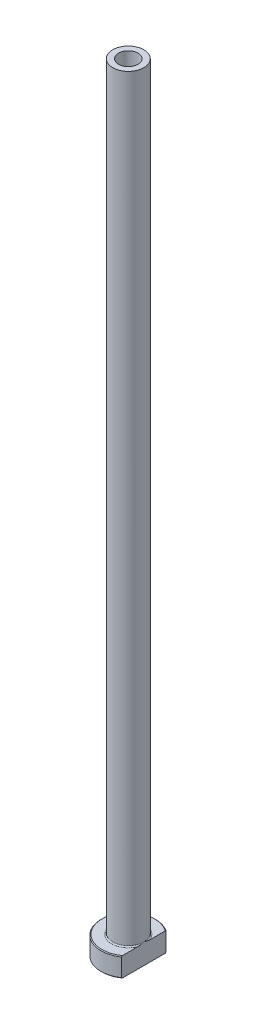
from build123d import *

# Parameters (mm, degrees)
FILLET1_R          = 0.3
CHAMFER1_SIZE      = 0.2
CUT_EXTRUDE1_DEPTH = 201.244850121
CHAMFER2_SIZE      = 0.5


with BuildPart() as part:
    # Sketch1 → Revolve1 (revolve)
    with BuildSketch(Plane.XY, mode=Mode.PRIVATE) as revolve1_sk:
        Polygon((-2.5, 200), (-4, 200), (-4, 5), (-7, 5), (-7, 0), (-2.75, 0), (-2.75, 143), (-2.5, 155), align=None)
    revolve(revolve1_sk.sketch.rotate(Axis((0, 92.187680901, 0), (0, -1, 0)), 270), axis=Axis((0, 92.187680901, 0), (0, -1, 0)))

    # Fillet1
    fillet1_edges = [part.edges().sort_by_distance(p)[0] for p in [
        (0, 5, -4),
    ]]
    fillet(fillet1_edges, radius=FILLET1_R)

    # Chamfer1
    chamfer1_edges = [part.edges().sort_by_distance(p)[0] for p in [
        (0, 0, -7),
        (0, 5, -7),
    ]]
    chamfer(chamfer1_edges, length=CHAMFER1_SIZE)

    # Sketch2 → Cut-Extrude1 (cut, through all)
    with BuildSketch(Plane.XZ):
        with BuildLine():
            Line((4, 5.744562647), (4, -5.744562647))
            ThreePointArc((4, -5.744562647), (7, 0), (4, 5.744562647))
        make_face()
    extrude(amount=-CUT_EXTRUDE1_DEPTH, mode=Mode.SUBTRACT)

    # Chamfer2
    chamfer2_edges = [part.edges().sort_by_distance(p)[0] for p in [
        (0, 0, -2.75),
    ]]
    chamfer(chamfer2_edges, length=CHAMFER2_SIZE)


solid = part.part
